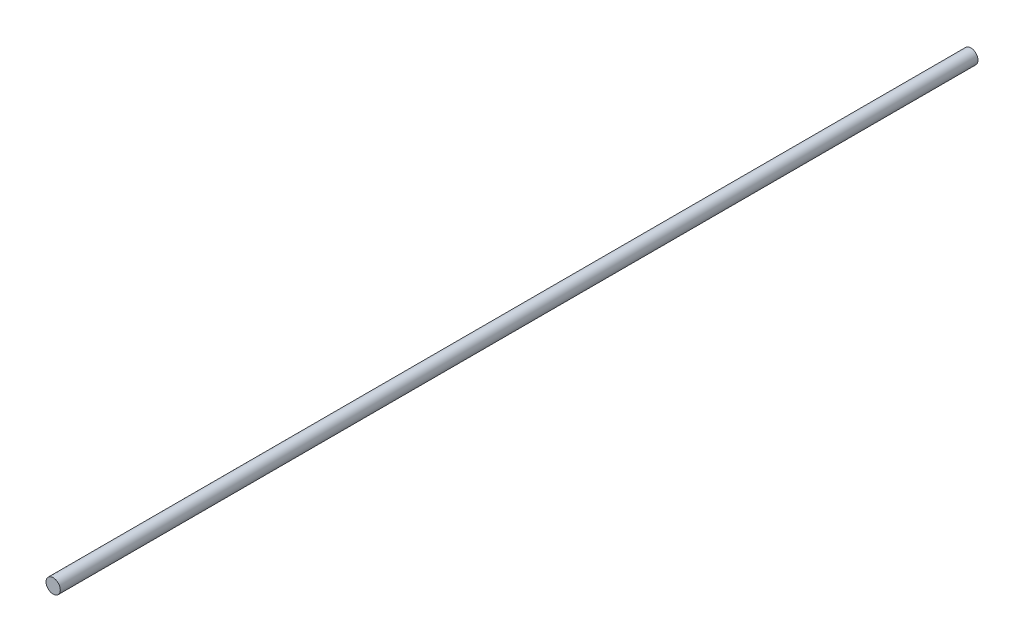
from build123d import *

# Parameters (mm, degrees)
SKETCH1_R           = 30
BOSS_EXTRUDE1_DEPTH = 3850


with BuildPart() as part:
    # Sketch1 → Boss-Extrude1 (new body)
    with BuildSketch(Plane.XY):
        Circle(SKETCH1_R)
    extrude(amount=-BOSS_EXTRUDE1_DEPTH)


solid = part.part
